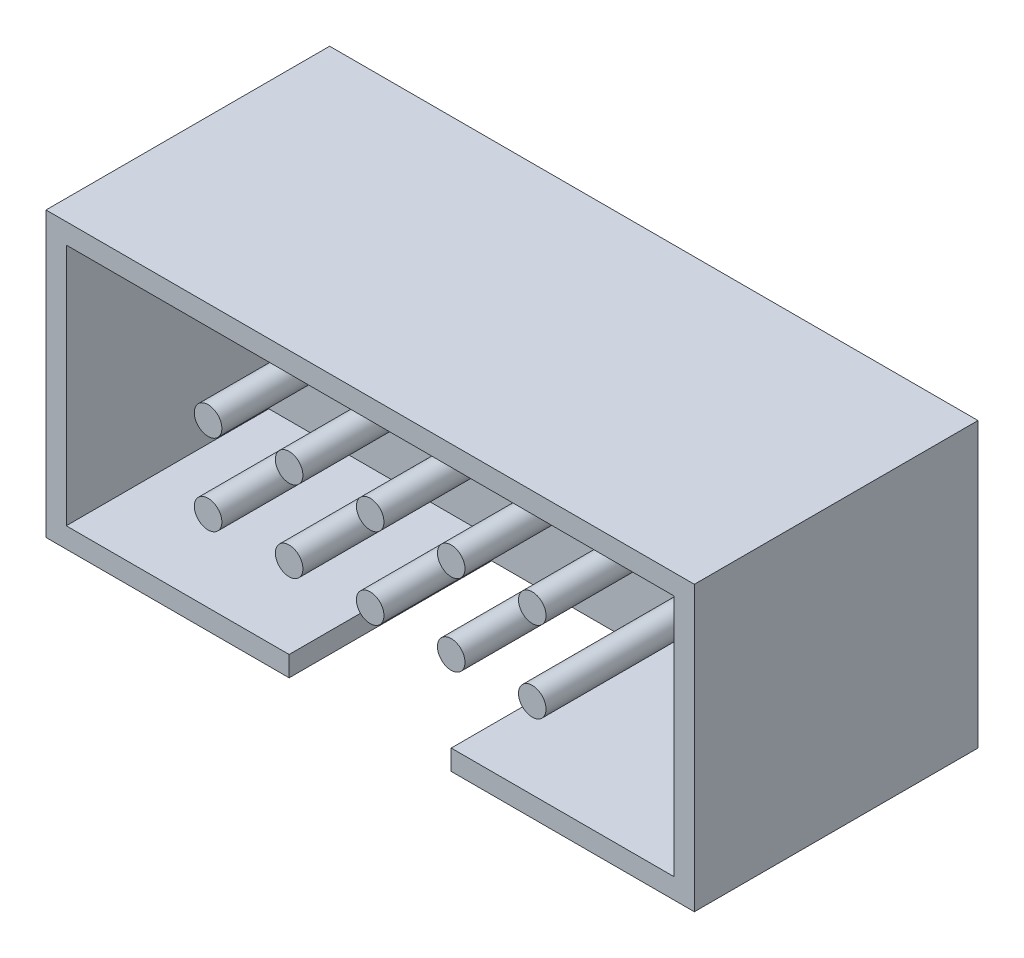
ISO-10303-21;
HEADER;
FILE_DESCRIPTION(('STEP AP214'),'2;1');
FILE_NAME('part.step','',(''),(''),'','','');
FILE_SCHEMA(('AUTOMOTIVE_DESIGN { 1 0 10303 214 1 1 1 1 }'));
ENDSEC;
DATA;
#1=APPLICATION_CONTEXT('core data for automotive mechanical design processes');
#2=APPLICATION_PROTOCOL_DEFINITION('international standard','automotive_design',2000,#1);
#3=PRODUCT_CONTEXT('',#1,'mechanical');
#4=PRODUCT('Part','Part','',(#3));
#5=PRODUCT_RELATED_PRODUCT_CATEGORY('part','',(#4));
#6=PRODUCT_DEFINITION_FORMATION('','',#4);
#7=PRODUCT_DEFINITION_CONTEXT('part definition',#1,'design');
#8=PRODUCT_DEFINITION('design','',#6,#7);
#9=PRODUCT_DEFINITION_SHAPE('','',#8);
#10=(LENGTH_UNIT() NAMED_UNIT(*) SI_UNIT(.MILLI.,.METRE.));
#11=(NAMED_UNIT(*) PLANE_ANGLE_UNIT() SI_UNIT($,.RADIAN.));
#12=(NAMED_UNIT(*) SI_UNIT($,.STERADIAN.) SOLID_ANGLE_UNIT());
#13=UNCERTAINTY_MEASURE_WITH_UNIT(LENGTH_MEASURE(1.E-05),#10,'distance_accuracy_value','');
#14=(GEOMETRIC_REPRESENTATION_CONTEXT(3) GLOBAL_UNCERTAINTY_ASSIGNED_CONTEXT((#13)) GLOBAL_UNIT_ASSIGNED_CONTEXT((#10,
#11,#12)) REPRESENTATION_CONTEXT('',''));
#15=CARTESIAN_POINT('',(0.,0.,0.));
#16=DIRECTION('',(0.,0.,1.));
#17=DIRECTION('',(1.,0.,0.));
#18=AXIS2_PLACEMENT_3D('',#15,#16,#17);
#19=CARTESIAN_POINT('',(10.16,2.54,8.89));
#20=DIRECTION('',(0.,0.,-1.));
#21=DIRECTION('',(-1.,0.,0.));
#22=AXIS2_PLACEMENT_3D('',#19,#20,#21);
#23=CYLINDRICAL_SURFACE('',#22,0.4318);
#24=CARTESIAN_POINT('',(10.16,2.54,8.89));
#25=DIRECTION('',(0.,0.,-1.));
#26=DIRECTION('',(-1.,0.,0.));
#27=AXIS2_PLACEMENT_3D('',#24,#25,#26);
#28=CIRCLE('',#27,0.4318);
#29=CARTESIAN_POINT('',(9.7282,2.54,8.89));
#30=VERTEX_POINT('',#29);
#31=EDGE_CURVE('E11',#30,#30,#28,.T.);
#32=ORIENTED_EDGE('',*,*,#31,.T.);
#33=EDGE_LOOP('',(#32));
#34=FACE_BOUND('',#33,.T.);
#35=CARTESIAN_POINT('',(10.16,2.54,-2.54));
#36=DIRECTION('',(0.,0.,-1.));
#37=DIRECTION('',(-1.,0.,0.));
#38=AXIS2_PLACEMENT_3D('',#35,#36,#37);
#39=CIRCLE('',#38,0.4318);
#40=CARTESIAN_POINT('',(9.7282,2.54,-2.54));
#41=VERTEX_POINT('',#40);
#42=EDGE_CURVE('E46',#41,#41,#39,.T.);
#43=ORIENTED_EDGE('',*,*,#42,.F.);
#44=EDGE_LOOP('',(#43));
#45=FACE_BOUND('',#44,.T.);
#46=ADVANCED_FACE('F40',(#34,#45),#23,.T.);
#47=CARTESIAN_POINT('',(10.16,2.54,8.89));
#48=DIRECTION('',(0.,0.,-1.));
#49=DIRECTION('',(-1.,0.,0.));
#50=AXIS2_PLACEMENT_3D('',#47,#48,#49);
#51=PLANE('',#50);
#52=ORIENTED_EDGE('',*,*,#31,.F.);
#53=EDGE_LOOP('',(#52));
#54=FACE_BOUND('',#53,.T.);
#55=ADVANCED_FACE('F55',(#54),#51,.F.);
#56=CARTESIAN_POINT('',(10.16,2.54,-2.54));
#57=DIRECTION('',(0.,0.,-1.));
#58=DIRECTION('',(-1.,0.,0.));
#59=AXIS2_PLACEMENT_3D('',#56,#57,#58);
#60=PLANE('',#59);
#61=ORIENTED_EDGE('',*,*,#42,.T.);
#62=EDGE_LOOP('',(#61));
#63=FACE_BOUND('',#62,.T.);
#64=ADVANCED_FACE('F52',(#63),#60,.T.);
#65=CLOSED_SHELL('',(#46,#55,#64));
#66=MANIFOLD_SOLID_BREP('B2',#65);
#67=CARTESIAN_POINT('',(7.62,2.54,8.89));
#68=DIRECTION('',(0.,0.,-1.));
#69=DIRECTION('',(-1.,0.,0.));
#70=AXIS2_PLACEMENT_3D('',#67,#68,#69);
#71=CYLINDRICAL_SURFACE('',#70,0.4318);
#72=CARTESIAN_POINT('',(7.62,2.54,8.89));
#73=DIRECTION('',(0.,0.,-1.));
#74=DIRECTION('',(-1.,0.,0.));
#75=AXIS2_PLACEMENT_3D('',#72,#73,#74);
#76=CIRCLE('',#75,0.4318);
#77=CARTESIAN_POINT('',(7.1882,2.54,8.89));
#78=VERTEX_POINT('',#77);
#79=EDGE_CURVE('E39',#78,#78,#76,.T.);
#80=ORIENTED_EDGE('',*,*,#79,.T.);
#81=EDGE_LOOP('',(#80));
#82=FACE_BOUND('',#81,.T.);
#83=CARTESIAN_POINT('',(7.62,2.54,-2.54));
#84=DIRECTION('',(0.,0.,-1.));
#85=DIRECTION('',(-1.,0.,0.));
#86=AXIS2_PLACEMENT_3D('',#83,#84,#85);
#87=CIRCLE('',#86,0.4318);
#88=CARTESIAN_POINT('',(7.1882,2.54,-2.54));
#89=VERTEX_POINT('',#88);
#90=EDGE_CURVE('E95',#89,#89,#87,.T.);
#91=ORIENTED_EDGE('',*,*,#90,.F.);
#92=EDGE_LOOP('',(#91));
#93=FACE_BOUND('',#92,.T.);
#94=ADVANCED_FACE('F89',(#82,#93),#71,.T.);
#95=CARTESIAN_POINT('',(7.62,2.54,8.89));
#96=DIRECTION('',(0.,0.,-1.));
#97=DIRECTION('',(-1.,0.,0.));
#98=AXIS2_PLACEMENT_3D('',#95,#96,#97);
#99=PLANE('',#98);
#100=ORIENTED_EDGE('',*,*,#79,.F.);
#101=EDGE_LOOP('',(#100));
#102=FACE_BOUND('',#101,.T.);
#103=ADVANCED_FACE('F104',(#102),#99,.F.);
#104=CARTESIAN_POINT('',(7.62,2.54,-2.54));
#105=DIRECTION('',(0.,0.,-1.));
#106=DIRECTION('',(-1.,0.,0.));
#107=AXIS2_PLACEMENT_3D('',#104,#105,#106);
#108=PLANE('',#107);
#109=ORIENTED_EDGE('',*,*,#90,.T.);
#110=EDGE_LOOP('',(#109));
#111=FACE_BOUND('',#110,.T.);
#112=ADVANCED_FACE('F101',(#111),#108,.T.);
#113=CLOSED_SHELL('',(#94,#103,#112));
#114=MANIFOLD_SOLID_BREP('B6',#113);
#115=CARTESIAN_POINT('',(5.08,2.54,8.89));
#116=DIRECTION('',(0.,0.,-1.));
#117=DIRECTION('',(-1.,0.,0.));
#118=AXIS2_PLACEMENT_3D('',#115,#116,#117);
#119=CYLINDRICAL_SURFACE('',#118,0.4318);
#120=CARTESIAN_POINT('',(5.08,2.54,8.89));
#121=DIRECTION('',(0.,0.,-1.));
#122=DIRECTION('',(-1.,0.,0.));
#123=AXIS2_PLACEMENT_3D('',#120,#121,#122);
#124=CIRCLE('',#123,0.4318);
#125=CARTESIAN_POINT('',(4.6482,2.54,8.89));
#126=VERTEX_POINT('',#125);
#127=EDGE_CURVE('E88',#126,#126,#124,.T.);
#128=ORIENTED_EDGE('',*,*,#127,.T.);
#129=EDGE_LOOP('',(#128));
#130=FACE_BOUND('',#129,.T.);
#131=CARTESIAN_POINT('',(5.08,2.54,-2.54));
#132=DIRECTION('',(0.,0.,-1.));
#133=DIRECTION('',(-1.,0.,0.));
#134=AXIS2_PLACEMENT_3D('',#131,#132,#133);
#135=CIRCLE('',#134,0.4318);
#136=CARTESIAN_POINT('',(4.6482,2.54,-2.54));
#137=VERTEX_POINT('',#136);
#138=EDGE_CURVE('E144',#137,#137,#135,.T.);
#139=ORIENTED_EDGE('',*,*,#138,.F.);
#140=EDGE_LOOP('',(#139));
#141=FACE_BOUND('',#140,.T.);
#142=ADVANCED_FACE('F138',(#130,#141),#119,.T.);
#143=CARTESIAN_POINT('',(5.08,2.54,8.89));
#144=DIRECTION('',(0.,0.,-1.));
#145=DIRECTION('',(-1.,0.,0.));
#146=AXIS2_PLACEMENT_3D('',#143,#144,#145);
#147=PLANE('',#146);
#148=ORIENTED_EDGE('',*,*,#127,.F.);
#149=EDGE_LOOP('',(#148));
#150=FACE_BOUND('',#149,.T.);
#151=ADVANCED_FACE('F153',(#150),#147,.F.);
#152=CARTESIAN_POINT('',(5.08,2.54,-2.54));
#153=DIRECTION('',(0.,0.,-1.));
#154=DIRECTION('',(-1.,0.,0.));
#155=AXIS2_PLACEMENT_3D('',#152,#153,#154);
#156=PLANE('',#155);
#157=ORIENTED_EDGE('',*,*,#138,.T.);
#158=EDGE_LOOP('',(#157));
#159=FACE_BOUND('',#158,.T.);
#160=ADVANCED_FACE('F150',(#159),#156,.T.);
#161=CLOSED_SHELL('',(#142,#151,#160));
#162=MANIFOLD_SOLID_BREP('B34',#161);
#163=CARTESIAN_POINT('',(2.54,2.54,8.89));
#164=DIRECTION('',(0.,0.,-1.));
#165=DIRECTION('',(-1.,0.,0.));
#166=AXIS2_PLACEMENT_3D('',#163,#164,#165);
#167=CYLINDRICAL_SURFACE('',#166,0.4318);
#168=CARTESIAN_POINT('',(2.54,2.54,8.89));
#169=DIRECTION('',(0.,0.,-1.));
#170=DIRECTION('',(-1.,0.,0.));
#171=AXIS2_PLACEMENT_3D('',#168,#169,#170);
#172=CIRCLE('',#171,0.4318);
#173=CARTESIAN_POINT('',(2.1082,2.54,8.89));
#174=VERTEX_POINT('',#173);
#175=EDGE_CURVE('E137',#174,#174,#172,.T.);
#176=ORIENTED_EDGE('',*,*,#175,.T.);
#177=EDGE_LOOP('',(#176));
#178=FACE_BOUND('',#177,.T.);
#179=CARTESIAN_POINT('',(2.54,2.54,-2.54));
#180=DIRECTION('',(0.,0.,-1.));
#181=DIRECTION('',(-1.,0.,0.));
#182=AXIS2_PLACEMENT_3D('',#179,#180,#181);
#183=CIRCLE('',#182,0.4318);
#184=CARTESIAN_POINT('',(2.1082,2.54,-2.54));
#185=VERTEX_POINT('',#184);
#186=EDGE_CURVE('E193',#185,#185,#183,.T.);
#187=ORIENTED_EDGE('',*,*,#186,.F.);
#188=EDGE_LOOP('',(#187));
#189=FACE_BOUND('',#188,.T.);
#190=ADVANCED_FACE('F187',(#178,#189),#167,.T.);
#191=CARTESIAN_POINT('',(2.54,2.54,8.89));
#192=DIRECTION('',(0.,0.,-1.));
#193=DIRECTION('',(-1.,0.,0.));
#194=AXIS2_PLACEMENT_3D('',#191,#192,#193);
#195=PLANE('',#194);
#196=ORIENTED_EDGE('',*,*,#175,.F.);
#197=EDGE_LOOP('',(#196));
#198=FACE_BOUND('',#197,.T.);
#199=ADVANCED_FACE('F202',(#198),#195,.F.);
#200=CARTESIAN_POINT('',(2.54,2.54,-2.54));
#201=DIRECTION('',(0.,0.,-1.));
#202=DIRECTION('',(-1.,0.,0.));
#203=AXIS2_PLACEMENT_3D('',#200,#201,#202);
#204=PLANE('',#203);
#205=ORIENTED_EDGE('',*,*,#186,.T.);
#206=EDGE_LOOP('',(#205));
#207=FACE_BOUND('',#206,.T.);
#208=ADVANCED_FACE('F199',(#207),#204,.T.);
#209=CLOSED_SHELL('',(#190,#199,#208));
#210=MANIFOLD_SOLID_BREP('B83',#209);
#211=CARTESIAN_POINT('',(10.16,0.,8.89));
#212=DIRECTION('',(0.,0.,-1.));
#213=DIRECTION('',(-1.,0.,0.));
#214=AXIS2_PLACEMENT_3D('',#211,#212,#213);
#215=CYLINDRICAL_SURFACE('',#214,0.4318);
#216=CARTESIAN_POINT('',(10.16,0.,8.89));
#217=DIRECTION('',(0.,0.,-1.));
#218=DIRECTION('',(-1.,0.,0.));
#219=AXIS2_PLACEMENT_3D('',#216,#217,#218);
#220=CIRCLE('',#219,0.4318);
#221=CARTESIAN_POINT('',(9.7282,0.,8.89));
#222=VERTEX_POINT('',#221);
#223=EDGE_CURVE('E186',#222,#222,#220,.T.);
#224=ORIENTED_EDGE('',*,*,#223,.T.);
#225=EDGE_LOOP('',(#224));
#226=FACE_BOUND('',#225,.T.);
#227=CARTESIAN_POINT('',(10.16,0.,-2.54));
#228=DIRECTION('',(0.,0.,-1.));
#229=DIRECTION('',(-1.,0.,0.));
#230=AXIS2_PLACEMENT_3D('',#227,#228,#229);
#231=CIRCLE('',#230,0.4318);
#232=CARTESIAN_POINT('',(9.7282,0.,-2.54));
#233=VERTEX_POINT('',#232);
#234=EDGE_CURVE('E242',#233,#233,#231,.T.);
#235=ORIENTED_EDGE('',*,*,#234,.F.);
#236=EDGE_LOOP('',(#235));
#237=FACE_BOUND('',#236,.T.);
#238=ADVANCED_FACE('F236',(#226,#237),#215,.T.);
#239=CARTESIAN_POINT('',(10.16,0.,8.89));
#240=DIRECTION('',(0.,0.,-1.));
#241=DIRECTION('',(-1.,0.,0.));
#242=AXIS2_PLACEMENT_3D('',#239,#240,#241);
#243=PLANE('',#242);
#244=ORIENTED_EDGE('',*,*,#223,.F.);
#245=EDGE_LOOP('',(#244));
#246=FACE_BOUND('',#245,.T.);
#247=ADVANCED_FACE('F251',(#246),#243,.F.);
#248=CARTESIAN_POINT('',(10.16,0.,-2.54));
#249=DIRECTION('',(0.,0.,-1.));
#250=DIRECTION('',(-1.,0.,0.));
#251=AXIS2_PLACEMENT_3D('',#248,#249,#250);
#252=PLANE('',#251);
#253=ORIENTED_EDGE('',*,*,#234,.T.);
#254=EDGE_LOOP('',(#253));
#255=FACE_BOUND('',#254,.T.);
#256=ADVANCED_FACE('F248',(#255),#252,.T.);
#257=CLOSED_SHELL('',(#238,#247,#256));
#258=MANIFOLD_SOLID_BREP('B132',#257);
#259=CARTESIAN_POINT('',(7.62,0.,8.89));
#260=DIRECTION('',(0.,0.,-1.));
#261=DIRECTION('',(-1.,0.,0.));
#262=AXIS2_PLACEMENT_3D('',#259,#260,#261);
#263=CYLINDRICAL_SURFACE('',#262,0.4318);
#264=CARTESIAN_POINT('',(7.62,0.,8.89));
#265=DIRECTION('',(0.,0.,-1.));
#266=DIRECTION('',(-1.,0.,0.));
#267=AXIS2_PLACEMENT_3D('',#264,#265,#266);
#268=CIRCLE('',#267,0.4318);
#269=CARTESIAN_POINT('',(7.1882,0.,8.89));
#270=VERTEX_POINT('',#269);
#271=EDGE_CURVE('E235',#270,#270,#268,.T.);
#272=ORIENTED_EDGE('',*,*,#271,.T.);
#273=EDGE_LOOP('',(#272));
#274=FACE_BOUND('',#273,.T.);
#275=CARTESIAN_POINT('',(7.62,0.,-2.54));
#276=DIRECTION('',(0.,0.,-1.));
#277=DIRECTION('',(-1.,0.,0.));
#278=AXIS2_PLACEMENT_3D('',#275,#276,#277);
#279=CIRCLE('',#278,0.4318);
#280=CARTESIAN_POINT('',(7.1882,0.,-2.54));
#281=VERTEX_POINT('',#280);
#282=EDGE_CURVE('E291',#281,#281,#279,.T.);
#283=ORIENTED_EDGE('',*,*,#282,.F.);
#284=EDGE_LOOP('',(#283));
#285=FACE_BOUND('',#284,.T.);
#286=ADVANCED_FACE('F285',(#274,#285),#263,.T.);
#287=CARTESIAN_POINT('',(7.62,0.,8.89));
#288=DIRECTION('',(0.,0.,-1.));
#289=DIRECTION('',(-1.,0.,0.));
#290=AXIS2_PLACEMENT_3D('',#287,#288,#289);
#291=PLANE('',#290);
#292=ORIENTED_EDGE('',*,*,#271,.F.);
#293=EDGE_LOOP('',(#292));
#294=FACE_BOUND('',#293,.T.);
#295=ADVANCED_FACE('F300',(#294),#291,.F.);
#296=CARTESIAN_POINT('',(7.62,0.,-2.54));
#297=DIRECTION('',(0.,0.,-1.));
#298=DIRECTION('',(-1.,0.,0.));
#299=AXIS2_PLACEMENT_3D('',#296,#297,#298);
#300=PLANE('',#299);
#301=ORIENTED_EDGE('',*,*,#282,.T.);
#302=EDGE_LOOP('',(#301));
#303=FACE_BOUND('',#302,.T.);
#304=ADVANCED_FACE('F297',(#303),#300,.T.);
#305=CLOSED_SHELL('',(#286,#295,#304));
#306=MANIFOLD_SOLID_BREP('B181',#305);
#307=CARTESIAN_POINT('',(5.08,0.,8.89));
#308=DIRECTION('',(0.,0.,-1.));
#309=DIRECTION('',(-1.,0.,0.));
#310=AXIS2_PLACEMENT_3D('',#307,#308,#309);
#311=CYLINDRICAL_SURFACE('',#310,0.4318);
#312=CARTESIAN_POINT('',(5.08,0.,8.89));
#313=DIRECTION('',(0.,0.,-1.));
#314=DIRECTION('',(-1.,0.,0.));
#315=AXIS2_PLACEMENT_3D('',#312,#313,#314);
#316=CIRCLE('',#315,0.4318);
#317=CARTESIAN_POINT('',(4.6482,0.,8.89));
#318=VERTEX_POINT('',#317);
#319=EDGE_CURVE('E284',#318,#318,#316,.T.);
#320=ORIENTED_EDGE('',*,*,#319,.T.);
#321=EDGE_LOOP('',(#320));
#322=FACE_BOUND('',#321,.T.);
#323=CARTESIAN_POINT('',(5.08,0.,-2.54));
#324=DIRECTION('',(0.,0.,-1.));
#325=DIRECTION('',(-1.,0.,0.));
#326=AXIS2_PLACEMENT_3D('',#323,#324,#325);
#327=CIRCLE('',#326,0.4318);
#328=CARTESIAN_POINT('',(4.6482,0.,-2.54));
#329=VERTEX_POINT('',#328);
#330=EDGE_CURVE('E340',#329,#329,#327,.T.);
#331=ORIENTED_EDGE('',*,*,#330,.F.);
#332=EDGE_LOOP('',(#331));
#333=FACE_BOUND('',#332,.T.);
#334=ADVANCED_FACE('F334',(#322,#333),#311,.T.);
#335=CARTESIAN_POINT('',(5.08,0.,8.89));
#336=DIRECTION('',(0.,0.,-1.));
#337=DIRECTION('',(-1.,0.,0.));
#338=AXIS2_PLACEMENT_3D('',#335,#336,#337);
#339=PLANE('',#338);
#340=ORIENTED_EDGE('',*,*,#319,.F.);
#341=EDGE_LOOP('',(#340));
#342=FACE_BOUND('',#341,.T.);
#343=ADVANCED_FACE('F349',(#342),#339,.F.);
#344=CARTESIAN_POINT('',(5.08,0.,-2.54));
#345=DIRECTION('',(0.,0.,-1.));
#346=DIRECTION('',(-1.,0.,0.));
#347=AXIS2_PLACEMENT_3D('',#344,#345,#346);
#348=PLANE('',#347);
#349=ORIENTED_EDGE('',*,*,#330,.T.);
#350=EDGE_LOOP('',(#349));
#351=FACE_BOUND('',#350,.T.);
#352=ADVANCED_FACE('F346',(#351),#348,.T.);
#353=CLOSED_SHELL('',(#334,#343,#352));
#354=MANIFOLD_SOLID_BREP('B230',#353);
#355=CARTESIAN_POINT('',(2.54,0.,8.89));
#356=DIRECTION('',(0.,0.,-1.));
#357=DIRECTION('',(-1.,0.,0.));
#358=AXIS2_PLACEMENT_3D('',#355,#356,#357);
#359=CYLINDRICAL_SURFACE('',#358,0.4318);
#360=CARTESIAN_POINT('',(2.54,0.,8.89));
#361=DIRECTION('',(0.,0.,-1.));
#362=DIRECTION('',(-1.,0.,0.));
#363=AXIS2_PLACEMENT_3D('',#360,#361,#362);
#364=CIRCLE('',#363,0.4318);
#365=CARTESIAN_POINT('',(2.1082,0.,8.89));
#366=VERTEX_POINT('',#365);
#367=EDGE_CURVE('E333',#366,#366,#364,.T.);
#368=ORIENTED_EDGE('',*,*,#367,.T.);
#369=EDGE_LOOP('',(#368));
#370=FACE_BOUND('',#369,.T.);
#371=CARTESIAN_POINT('',(2.54,0.,-2.54));
#372=DIRECTION('',(0.,0.,-1.));
#373=DIRECTION('',(-1.,0.,0.));
#374=AXIS2_PLACEMENT_3D('',#371,#372,#373);
#375=CIRCLE('',#374,0.4318);
#376=CARTESIAN_POINT('',(2.1082,0.,-2.54));
#377=VERTEX_POINT('',#376);
#378=EDGE_CURVE('E389',#377,#377,#375,.T.);
#379=ORIENTED_EDGE('',*,*,#378,.F.);
#380=EDGE_LOOP('',(#379));
#381=FACE_BOUND('',#380,.T.);
#382=ADVANCED_FACE('F383',(#370,#381),#359,.T.);
#383=CARTESIAN_POINT('',(2.54,0.,8.89));
#384=DIRECTION('',(0.,0.,-1.));
#385=DIRECTION('',(-1.,0.,0.));
#386=AXIS2_PLACEMENT_3D('',#383,#384,#385);
#387=PLANE('',#386);
#388=ORIENTED_EDGE('',*,*,#367,.F.);
#389=EDGE_LOOP('',(#388));
#390=FACE_BOUND('',#389,.T.);
#391=ADVANCED_FACE('F398',(#390),#387,.F.);
#392=CARTESIAN_POINT('',(2.54,0.,-2.54));
#393=DIRECTION('',(0.,0.,-1.));
#394=DIRECTION('',(-1.,0.,0.));
#395=AXIS2_PLACEMENT_3D('',#392,#393,#394);
#396=PLANE('',#395);
#397=ORIENTED_EDGE('',*,*,#378,.T.);
#398=EDGE_LOOP('',(#397));
#399=FACE_BOUND('',#398,.T.);
#400=ADVANCED_FACE('F395',(#399),#396,.T.);
#401=CLOSED_SHELL('',(#382,#391,#400));
#402=MANIFOLD_SOLID_BREP('B279',#401);
#403=CARTESIAN_POINT('',(0.,2.54,8.89));
#404=DIRECTION('',(0.,0.,-1.));
#405=DIRECTION('',(-1.,0.,0.));
#406=AXIS2_PLACEMENT_3D('',#403,#404,#405);
#407=CYLINDRICAL_SURFACE('',#406,0.4318);
#408=CARTESIAN_POINT('',(0.,2.54,8.89));
#409=DIRECTION('',(0.,0.,-1.));
#410=DIRECTION('',(-1.,0.,0.));
#411=AXIS2_PLACEMENT_3D('',#408,#409,#410);
#412=CIRCLE('',#411,0.4318);
#413=CARTESIAN_POINT('',(-0.4318,2.54,8.89));
#414=VERTEX_POINT('',#413);
#415=EDGE_CURVE('E382',#414,#414,#412,.T.);
#416=ORIENTED_EDGE('',*,*,#415,.T.);
#417=EDGE_LOOP('',(#416));
#418=FACE_BOUND('',#417,.T.);
#419=CARTESIAN_POINT('',(0.,2.54,-2.54));
#420=DIRECTION('',(0.,0.,-1.));
#421=DIRECTION('',(-1.,0.,0.));
#422=AXIS2_PLACEMENT_3D('',#419,#420,#421);
#423=CIRCLE('',#422,0.4318);
#424=CARTESIAN_POINT('',(-0.4318,2.54,-2.54));
#425=VERTEX_POINT('',#424);
#426=EDGE_CURVE('E438',#425,#425,#423,.T.);
#427=ORIENTED_EDGE('',*,*,#426,.F.);
#428=EDGE_LOOP('',(#427));
#429=FACE_BOUND('',#428,.T.);
#430=ADVANCED_FACE('F432',(#418,#429),#407,.T.);
#431=CARTESIAN_POINT('',(0.,2.54,8.89));
#432=DIRECTION('',(0.,0.,-1.));
#433=DIRECTION('',(-1.,0.,0.));
#434=AXIS2_PLACEMENT_3D('',#431,#432,#433);
#435=PLANE('',#434);
#436=ORIENTED_EDGE('',*,*,#415,.F.);
#437=EDGE_LOOP('',(#436));
#438=FACE_BOUND('',#437,.T.);
#439=ADVANCED_FACE('F447',(#438),#435,.F.);
#440=CARTESIAN_POINT('',(0.,2.54,-2.54));
#441=DIRECTION('',(0.,0.,-1.));
#442=DIRECTION('',(-1.,0.,0.));
#443=AXIS2_PLACEMENT_3D('',#440,#441,#442);
#444=PLANE('',#443);
#445=ORIENTED_EDGE('',*,*,#426,.T.);
#446=EDGE_LOOP('',(#445));
#447=FACE_BOUND('',#446,.T.);
#448=ADVANCED_FACE('F444',(#447),#444,.T.);
#449=CLOSED_SHELL('',(#430,#439,#448));
#450=MANIFOLD_SOLID_BREP('B328',#449);
#451=CARTESIAN_POINT('',(0.,0.,8.89));
#452=DIRECTION('',(0.,0.,-1.));
#453=DIRECTION('',(-1.,0.,0.));
#454=AXIS2_PLACEMENT_3D('',#451,#452,#453);
#455=CYLINDRICAL_SURFACE('',#454,0.4318);
#456=CARTESIAN_POINT('',(0.,0.,8.89));
#457=DIRECTION('',(0.,0.,-1.));
#458=DIRECTION('',(-1.,0.,0.));
#459=AXIS2_PLACEMENT_3D('',#456,#457,#458);
#460=CIRCLE('',#459,0.4318);
#461=CARTESIAN_POINT('',(-0.4318,0.,8.89));
#462=VERTEX_POINT('',#461);
#463=EDGE_CURVE('E431',#462,#462,#460,.T.);
#464=ORIENTED_EDGE('',*,*,#463,.T.);
#465=EDGE_LOOP('',(#464));
#466=FACE_BOUND('',#465,.T.);
#467=CARTESIAN_POINT('',(0.,0.,-2.54));
#468=DIRECTION('',(0.,0.,-1.));
#469=DIRECTION('',(-1.,0.,0.));
#470=AXIS2_PLACEMENT_3D('',#467,#468,#469);
#471=CIRCLE('',#470,0.4318);
#472=CARTESIAN_POINT('',(-0.4318,0.,-2.54));
#473=VERTEX_POINT('',#472);
#474=EDGE_CURVE('E488',#473,#473,#471,.T.);
#475=ORIENTED_EDGE('',*,*,#474,.F.);
#476=EDGE_LOOP('',(#475));
#477=FACE_BOUND('',#476,.T.);
#478=ADVANCED_FACE('F482',(#466,#477),#455,.T.);
#479=CARTESIAN_POINT('',(0.,0.,8.89));
#480=DIRECTION('',(0.,0.,-1.));
#481=DIRECTION('',(-1.,0.,0.));
#482=AXIS2_PLACEMENT_3D('',#479,#480,#481);
#483=PLANE('',#482);
#484=ORIENTED_EDGE('',*,*,#463,.F.);
#485=EDGE_LOOP('',(#484));
#486=FACE_BOUND('',#485,.T.);
#487=ADVANCED_FACE('F497',(#486),#483,.F.);
#488=CARTESIAN_POINT('',(0.,0.,-2.54));
#489=DIRECTION('',(0.,0.,-1.));
#490=DIRECTION('',(-1.,0.,0.));
#491=AXIS2_PLACEMENT_3D('',#488,#489,#490);
#492=PLANE('',#491);
#493=ORIENTED_EDGE('',*,*,#474,.T.);
#494=EDGE_LOOP('',(#493));
#495=FACE_BOUND('',#494,.T.);
#496=ADVANCED_FACE('F494',(#495),#492,.T.);
#497=CLOSED_SHELL('',(#478,#487,#496));
#498=MANIFOLD_SOLID_BREP('B377',#497);
#499=CARTESIAN_POINT('',(-5.08,-3.175,2.54));
#500=DIRECTION('',(0.,0.,1.));
#501=DIRECTION('',(1.,0.,0.));
#502=AXIS2_PLACEMENT_3D('',#499,#500,#501);
#503=PLANE('',#502);
#504=DIRECTION('',(1.,0.,0.));
#505=VECTOR('',#504,1.);
#506=CARTESIAN_POINT('',(-5.08,-3.175,2.54));
#507=LINE('',#506,#505);
#508=CARTESIAN_POINT('',(2.54,-3.175,2.54));
#509=VERTEX_POINT('',#508);
#510=CARTESIAN_POINT('',(7.62,-3.175,2.54));
#511=VERTEX_POINT('',#510);
#512=EDGE_CURVE('E692',#509,#511,#507,.T.);
#513=ORIENTED_EDGE('',*,*,#512,.T.);
#514=DIRECTION('',(0.,-1.,0.));
#515=VECTOR('',#514,1.);
#516=CARTESIAN_POINT('',(7.62,-3.175,2.54));
#517=LINE('',#516,#515);
#518=CARTESIAN_POINT('',(7.62,-2.54,2.54));
#519=VERTEX_POINT('',#518);
#520=EDGE_CURVE('E642',#519,#511,#517,.T.);
#521=ORIENTED_EDGE('',*,*,#520,.F.);
#522=DIRECTION('',(-1.,0.,0.));
#523=VECTOR('',#522,1.);
#524=CARTESIAN_POINT('',(7.62,-2.54,2.54));
#525=LINE('',#524,#523);
#526=CARTESIAN_POINT('',(14.605,-2.54,2.54));
#527=VERTEX_POINT('',#526);
#528=EDGE_CURVE('E638',#527,#519,#525,.T.);
#529=ORIENTED_EDGE('',*,*,#528,.F.);
#530=DIRECTION('',(0.,-1.,0.));
#531=VECTOR('',#530,1.);
#532=CARTESIAN_POINT('',(14.605,5.715,2.54));
#533=LINE('',#532,#531);
#534=CARTESIAN_POINT('',(14.605,5.08,2.54));
#535=VERTEX_POINT('',#534);
#536=EDGE_CURVE('E672',#535,#527,#533,.T.);
#537=ORIENTED_EDGE('',*,*,#536,.F.);
#538=DIRECTION('',(1.,0.,0.));
#539=VECTOR('',#538,1.);
#540=CARTESIAN_POINT('',(-4.445,5.08,2.54));
#541=LINE('',#540,#539);
#542=CARTESIAN_POINT('',(-4.445,5.08,2.54));
#543=VERTEX_POINT('',#542);
#544=EDGE_CURVE('E664',#543,#535,#541,.T.);
#545=ORIENTED_EDGE('',*,*,#544,.F.);
#546=DIRECTION('',(0.,1.,0.));
#547=VECTOR('',#546,1.);
#548=CARTESIAN_POINT('',(-4.445,5.715,2.54));
#549=LINE('',#548,#547);
#550=CARTESIAN_POINT('',(-4.445,-2.54,2.54));
#551=VERTEX_POINT('',#550);
#552=EDGE_CURVE('E527',#551,#543,#549,.T.);
#553=ORIENTED_EDGE('',*,*,#552,.F.);
#554=DIRECTION('',(-1.,0.,0.));
#555=VECTOR('',#554,1.);
#556=CARTESIAN_POINT('',(-4.445,-2.54,2.54));
#557=LINE('',#556,#555);
#558=CARTESIAN_POINT('',(2.54,-2.54,2.54));
#559=VERTEX_POINT('',#558);
#560=EDGE_CURVE('E647',#559,#551,#557,.T.);
#561=ORIENTED_EDGE('',*,*,#560,.F.);
#562=DIRECTION('',(0.,1.,0.));
#563=VECTOR('',#562,1.);
#564=CARTESIAN_POINT('',(2.54,-3.175,2.54));
#565=LINE('',#564,#563);
#566=EDGE_CURVE('E644',#509,#559,#565,.T.);
#567=ORIENTED_EDGE('',*,*,#566,.F.);
#568=EDGE_LOOP('',(#513,#521,#529,#537,#545,#553,#561,#567));
#569=FACE_BOUND('',#568,.T.);
#570=ADVANCED_FACE('F523',(#569),#503,.T.);
#571=CARTESIAN_POINT('',(14.605,5.715,8.89));
#572=DIRECTION('',(1.,0.,0.));
#573=DIRECTION('',(0.,0.,-1.));
#574=AXIS2_PLACEMENT_3D('',#571,#572,#573);
#575=PLANE('',#574);
#576=DIRECTION('',(0.,0.,-1.));
#577=VECTOR('',#576,1.);
#578=CARTESIAN_POINT('',(14.605,-2.54,8.89));
#579=LINE('',#578,#577);
#580=CARTESIAN_POINT('',(14.605,-2.54,8.89));
#581=VERTEX_POINT('',#580);
#582=EDGE_CURVE('E645',#581,#527,#579,.T.);
#583=ORIENTED_EDGE('',*,*,#582,.F.);
#584=DIRECTION('',(0.,-1.,0.));
#585=VECTOR('',#584,1.);
#586=CARTESIAN_POINT('',(14.605,5.715,8.89));
#587=LINE('',#586,#585);
#588=CARTESIAN_POINT('',(14.605,5.08,8.89));
#589=VERTEX_POINT('',#588);
#590=EDGE_CURVE('E627',#589,#581,#587,.T.);
#591=ORIENTED_EDGE('',*,*,#590,.F.);
#592=DIRECTION('',(0.,0.,-1.));
#593=VECTOR('',#592,1.);
#594=CARTESIAN_POINT('',(14.605,5.08,8.89));
#595=LINE('',#594,#593);
#596=EDGE_CURVE('E549',#589,#535,#595,.T.);
#597=ORIENTED_EDGE('',*,*,#596,.T.);
#598=ORIENTED_EDGE('',*,*,#536,.T.);
#599=EDGE_LOOP('',(#583,#591,#597,#598));
#600=FACE_BOUND('',#599,.T.);
#601=ADVANCED_FACE('F729',(#600),#575,.F.);
#602=CARTESIAN_POINT('',(-4.445,5.715,8.89));
#603=DIRECTION('',(-1.,0.,0.));
#604=DIRECTION('',(0.,-1.,0.));
#605=AXIS2_PLACEMENT_3D('',#602,#603,#604);
#606=PLANE('',#605);
#607=DIRECTION('',(0.,0.,-1.));
#608=VECTOR('',#607,1.);
#609=CARTESIAN_POINT('',(-4.445,-2.54,8.89));
#610=LINE('',#609,#608);
#611=CARTESIAN_POINT('',(-4.445,-2.54,8.89));
#612=VERTEX_POINT('',#611);
#613=EDGE_CURVE('E541',#612,#551,#610,.T.);
#614=ORIENTED_EDGE('',*,*,#613,.T.);
#615=ORIENTED_EDGE('',*,*,#552,.T.);
#616=DIRECTION('',(0.,0.,-1.));
#617=VECTOR('',#616,1.);
#618=CARTESIAN_POINT('',(-4.445,5.08,8.89));
#619=LINE('',#618,#617);
#620=CARTESIAN_POINT('',(-4.445,5.08,8.89));
#621=VERTEX_POINT('',#620);
#622=EDGE_CURVE('E669',#621,#543,#619,.T.);
#623=ORIENTED_EDGE('',*,*,#622,.F.);
#624=DIRECTION('',(0.,1.,0.));
#625=VECTOR('',#624,1.);
#626=CARTESIAN_POINT('',(-4.445,5.715,8.89));
#627=LINE('',#626,#625);
#628=EDGE_CURVE('E682',#612,#621,#627,.T.);
#629=ORIENTED_EDGE('',*,*,#628,.F.);
#630=EDGE_LOOP('',(#614,#615,#623,#629));
#631=FACE_BOUND('',#630,.T.);
#632=ADVANCED_FACE('F735',(#631),#606,.F.);
#633=CARTESIAN_POINT('',(-5.08,5.715,2.54));
#634=DIRECTION('',(1.,0.,0.));
#635=DIRECTION('',(0.,1.,0.));
#636=AXIS2_PLACEMENT_3D('',#633,#634,#635);
#637=PLANE('',#636);
#638=DIRECTION('',(0.,-1.,0.));
#639=VECTOR('',#638,1.);
#640=CARTESIAN_POINT('',(-5.08,5.715,0.));
#641=LINE('',#640,#639);
#642=CARTESIAN_POINT('',(-5.08,5.715,0.));
#643=VERTEX_POINT('',#642);
#644=CARTESIAN_POINT('',(-5.08,-3.175,0.));
#645=VERTEX_POINT('',#644);
#646=EDGE_CURVE('E686',#643,#645,#641,.T.);
#647=ORIENTED_EDGE('',*,*,#646,.T.);
#648=DIRECTION('',(0.,0.,-1.));
#649=VECTOR('',#648,1.);
#650=CARTESIAN_POINT('',(-5.08,-3.175,2.54));
#651=LINE('',#650,#649);
#652=CARTESIAN_POINT('',(-5.08,-3.175,8.89));
#653=VERTEX_POINT('',#652);
#654=EDGE_CURVE('E480',#653,#645,#651,.T.);
#655=ORIENTED_EDGE('',*,*,#654,.F.);
#656=DIRECTION('',(0.,-1.,0.));
#657=VECTOR('',#656,1.);
#658=CARTESIAN_POINT('',(-5.08,5.715,8.89));
#659=LINE('',#658,#657);
#660=CARTESIAN_POINT('',(-5.08,5.715,8.89));
#661=VERTEX_POINT('',#660);
#662=EDGE_CURVE('E678',#661,#653,#659,.T.);
#663=ORIENTED_EDGE('',*,*,#662,.F.);
#664=DIRECTION('',(0.,0.,-1.));
#665=VECTOR('',#664,1.);
#666=CARTESIAN_POINT('',(-5.08,5.715,2.54));
#667=LINE('',#666,#665);
#668=EDGE_CURVE('E693',#661,#643,#667,.T.);
#669=ORIENTED_EDGE('',*,*,#668,.T.);
#670=EDGE_LOOP('',(#647,#655,#663,#669));
#671=FACE_BOUND('',#670,.T.);
#672=ADVANCED_FACE('F525',(#671),#637,.F.);
#673=CARTESIAN_POINT('',(-5.08,-3.175,2.54));
#674=DIRECTION('',(0.,1.,0.));
#675=DIRECTION('',(0.,0.,1.));
#676=AXIS2_PLACEMENT_3D('',#673,#674,#675);
#677=PLANE('',#676);
#678=DIRECTION('',(1.,0.,0.));
#679=VECTOR('',#678,1.);
#680=CARTESIAN_POINT('',(-5.08,-3.175,0.));
#681=LINE('',#680,#679);
#682=CARTESIAN_POINT('',(15.24,-3.175,0.));
#683=VERTEX_POINT('',#682);
#684=EDGE_CURVE('E704',#645,#683,#681,.T.);
#685=ORIENTED_EDGE('',*,*,#684,.T.);
#686=DIRECTION('',(0.,0.,-1.));
#687=VECTOR('',#686,1.);
#688=CARTESIAN_POINT('',(15.24,-3.175,2.54));
#689=LINE('',#688,#687);
#690=CARTESIAN_POINT('',(15.24,-3.175,8.89));
#691=VERTEX_POINT('',#690);
#692=EDGE_CURVE('E533',#691,#683,#689,.T.);
#693=ORIENTED_EDGE('',*,*,#692,.F.);
#694=DIRECTION('',(1.,0.,0.));
#695=VECTOR('',#694,1.);
#696=CARTESIAN_POINT('',(15.24,-3.175,8.89));
#697=LINE('',#696,#695);
#698=CARTESIAN_POINT('',(7.62,-3.175,8.89));
#699=VERTEX_POINT('',#698);
#700=EDGE_CURVE('E616',#699,#691,#697,.T.);
#701=ORIENTED_EDGE('',*,*,#700,.F.);
#702=DIRECTION('',(0.,0.,-1.));
#703=VECTOR('',#702,1.);
#704=CARTESIAN_POINT('',(7.62,-3.175,8.89));
#705=LINE('',#704,#703);
#706=EDGE_CURVE('E621',#699,#511,#705,.T.);
#707=ORIENTED_EDGE('',*,*,#706,.T.);
#708=ORIENTED_EDGE('',*,*,#512,.F.);
#709=DIRECTION('',(0.,0.,-1.));
#710=VECTOR('',#709,1.);
#711=CARTESIAN_POINT('',(2.54,-3.175,8.89));
#712=LINE('',#711,#710);
#713=CARTESIAN_POINT('',(2.54,-3.175,8.89));
#714=VERTEX_POINT('',#713);
#715=EDGE_CURVE('E662',#714,#509,#712,.T.);
#716=ORIENTED_EDGE('',*,*,#715,.F.);
#717=DIRECTION('',(1.,0.,0.));
#718=VECTOR('',#717,1.);
#719=CARTESIAN_POINT('',(-5.08,-3.175,8.89));
#720=LINE('',#719,#718);
#721=EDGE_CURVE('E680',#653,#714,#720,.T.);
#722=ORIENTED_EDGE('',*,*,#721,.F.);
#723=ORIENTED_EDGE('',*,*,#654,.T.);
#724=EDGE_LOOP('',(#685,#693,#701,#707,#708,#716,#722,#723));
#725=FACE_BOUND('',#724,.T.);
#726=ADVANCED_FACE('F618',(#725),#677,.F.);
#727=CARTESIAN_POINT('',(15.24,5.715,2.54));
#728=DIRECTION('',(-1.,0.,0.));
#729=DIRECTION('',(0.,0.,1.));
#730=AXIS2_PLACEMENT_3D('',#727,#728,#729);
#731=PLANE('',#730);
#732=DIRECTION('',(0.,1.,0.));
#733=VECTOR('',#732,1.);
#734=CARTESIAN_POINT('',(15.24,5.715,0.));
#735=LINE('',#734,#733);
#736=CARTESIAN_POINT('',(15.24,5.715,0.));
#737=VERTEX_POINT('',#736);
#738=EDGE_CURVE('E703',#683,#737,#735,.T.);
#739=ORIENTED_EDGE('',*,*,#738,.T.);
#740=DIRECTION('',(0.,0.,-1.));
#741=VECTOR('',#740,1.);
#742=CARTESIAN_POINT('',(15.24,5.715,2.54));
#743=LINE('',#742,#741);
#744=CARTESIAN_POINT('',(15.24,5.715,8.89));
#745=VERTEX_POINT('',#744);
#746=EDGE_CURVE('E697',#745,#737,#743,.T.);
#747=ORIENTED_EDGE('',*,*,#746,.F.);
#748=DIRECTION('',(0.,1.,0.));
#749=VECTOR('',#748,1.);
#750=CARTESIAN_POINT('',(15.24,5.715,8.89));
#751=LINE('',#750,#749);
#752=EDGE_CURVE('E673',#691,#745,#751,.T.);
#753=ORIENTED_EDGE('',*,*,#752,.F.);
#754=ORIENTED_EDGE('',*,*,#692,.T.);
#755=EDGE_LOOP('',(#739,#747,#753,#754));
#756=FACE_BOUND('',#755,.T.);
#757=ADVANCED_FACE('F720',(#756),#731,.F.);
#758=CARTESIAN_POINT('',(-5.08,5.715,2.54));
#759=DIRECTION('',(0.,-1.,0.));
#760=DIRECTION('',(0.,0.,-1.));
#761=AXIS2_PLACEMENT_3D('',#758,#759,#760);
#762=PLANE('',#761);
#763=DIRECTION('',(-1.,0.,0.));
#764=VECTOR('',#763,1.);
#765=CARTESIAN_POINT('',(-5.08,5.715,0.));
#766=LINE('',#765,#764);
#767=EDGE_CURVE('E694',#737,#643,#766,.T.);
#768=ORIENTED_EDGE('',*,*,#767,.T.);
#769=ORIENTED_EDGE('',*,*,#668,.F.);
#770=DIRECTION('',(-1.,0.,0.));
#771=VECTOR('',#770,1.);
#772=CARTESIAN_POINT('',(-5.08,5.715,8.89));
#773=LINE('',#772,#771);
#774=EDGE_CURVE('E684',#745,#661,#773,.T.);
#775=ORIENTED_EDGE('',*,*,#774,.F.);
#776=ORIENTED_EDGE('',*,*,#746,.T.);
#777=EDGE_LOOP('',(#768,#769,#775,#776));
#778=FACE_BOUND('',#777,.T.);
#779=ADVANCED_FACE('F718',(#778),#762,.F.);
#780=CARTESIAN_POINT('',(-5.08,-3.175,0.));
#781=DIRECTION('',(0.,0.,1.));
#782=DIRECTION('',(1.,0.,0.));
#783=AXIS2_PLACEMENT_3D('',#780,#781,#782);
#784=PLANE('',#783);
#785=ORIENTED_EDGE('',*,*,#646,.F.);
#786=ORIENTED_EDGE('',*,*,#767,.F.);
#787=ORIENTED_EDGE('',*,*,#738,.F.);
#788=ORIENTED_EDGE('',*,*,#684,.F.);
#789=EDGE_LOOP('',(#785,#786,#787,#788));
#790=FACE_BOUND('',#789,.T.);
#791=ADVANCED_FACE('F712',(#790),#784,.F.);
#792=CARTESIAN_POINT('',(-5.08,-3.175,8.89));
#793=DIRECTION('',(0.,0.,1.));
#794=DIRECTION('',(1.,0.,0.));
#795=AXIS2_PLACEMENT_3D('',#792,#793,#794);
#796=PLANE('',#795);
#797=ORIENTED_EDGE('',*,*,#662,.T.);
#798=ORIENTED_EDGE('',*,*,#721,.T.);
#799=DIRECTION('',(0.,1.,0.));
#800=VECTOR('',#799,1.);
#801=CARTESIAN_POINT('',(2.54,-3.175,8.89));
#802=LINE('',#801,#800);
#803=CARTESIAN_POINT('',(2.54,-2.54,8.89));
#804=VERTEX_POINT('',#803);
#805=EDGE_CURVE('E653',#714,#804,#802,.T.);
#806=ORIENTED_EDGE('',*,*,#805,.T.);
#807=DIRECTION('',(-1.,0.,0.));
#808=VECTOR('',#807,1.);
#809=CARTESIAN_POINT('',(-4.445,-2.54,8.89));
#810=LINE('',#809,#808);
#811=EDGE_CURVE('E655',#804,#612,#810,.T.);
#812=ORIENTED_EDGE('',*,*,#811,.T.);
#813=ORIENTED_EDGE('',*,*,#628,.T.);
#814=DIRECTION('',(1.,0.,0.));
#815=VECTOR('',#814,1.);
#816=CARTESIAN_POINT('',(-4.445,5.08,8.89));
#817=LINE('',#816,#815);
#818=EDGE_CURVE('E665',#621,#589,#817,.T.);
#819=ORIENTED_EDGE('',*,*,#818,.T.);
#820=ORIENTED_EDGE('',*,*,#590,.T.);
#821=DIRECTION('',(-1.,0.,0.));
#822=VECTOR('',#821,1.);
#823=CARTESIAN_POINT('',(7.62,-2.54,8.89));
#824=LINE('',#823,#822);
#825=CARTESIAN_POINT('',(7.62,-2.54,8.89));
#826=VERTEX_POINT('',#825);
#827=EDGE_CURVE('E634',#581,#826,#824,.T.);
#828=ORIENTED_EDGE('',*,*,#827,.T.);
#829=DIRECTION('',(0.,-1.,0.));
#830=VECTOR('',#829,1.);
#831=CARTESIAN_POINT('',(7.62,-3.175,8.89));
#832=LINE('',#831,#830);
#833=EDGE_CURVE('E630',#826,#699,#832,.T.);
#834=ORIENTED_EDGE('',*,*,#833,.T.);
#835=ORIENTED_EDGE('',*,*,#700,.T.);
#836=ORIENTED_EDGE('',*,*,#752,.T.);
#837=ORIENTED_EDGE('',*,*,#774,.T.);
#838=EDGE_LOOP('',(#797,#798,#806,#812,#813,#819,#820,#828,#834,#835,#836,#837));
#839=FACE_BOUND('',#838,.T.);
#840=ADVANCED_FACE('F632',(#839),#796,.T.);
#841=CARTESIAN_POINT('',(-4.445,5.08,8.89));
#842=DIRECTION('',(0.,1.,0.));
#843=DIRECTION('',(0.,0.,1.));
#844=AXIS2_PLACEMENT_3D('',#841,#842,#843);
#845=PLANE('',#844);
#846=ORIENTED_EDGE('',*,*,#544,.T.);
#847=ORIENTED_EDGE('',*,*,#596,.F.);
#848=ORIENTED_EDGE('',*,*,#818,.F.);
#849=ORIENTED_EDGE('',*,*,#622,.T.);
#850=EDGE_LOOP('',(#846,#847,#848,#849));
#851=FACE_BOUND('',#850,.T.);
#852=ADVANCED_FACE('F745',(#851),#845,.F.);
#853=CARTESIAN_POINT('',(2.54,-3.175,8.89));
#854=DIRECTION('',(-1.,0.,0.));
#855=DIRECTION('',(0.,0.,1.));
#856=AXIS2_PLACEMENT_3D('',#853,#854,#855);
#857=PLANE('',#856);
#858=ORIENTED_EDGE('',*,*,#566,.T.);
#859=DIRECTION('',(0.,0.,-1.));
#860=VECTOR('',#859,1.);
#861=CARTESIAN_POINT('',(2.54,-2.54,8.89));
#862=LINE('',#861,#860);
#863=EDGE_CURVE('E659',#804,#559,#862,.T.);
#864=ORIENTED_EDGE('',*,*,#863,.F.);
#865=ORIENTED_EDGE('',*,*,#805,.F.);
#866=ORIENTED_EDGE('',*,*,#715,.T.);
#867=EDGE_LOOP('',(#858,#864,#865,#866));
#868=FACE_BOUND('',#867,.T.);
#869=ADVANCED_FACE('F749',(#868),#857,.F.);
#870=CARTESIAN_POINT('',(-4.445,-2.54,8.89));
#871=DIRECTION('',(0.,-1.,0.));
#872=DIRECTION('',(0.,0.,-1.));
#873=AXIS2_PLACEMENT_3D('',#870,#871,#872);
#874=PLANE('',#873);
#875=ORIENTED_EDGE('',*,*,#560,.T.);
#876=ORIENTED_EDGE('',*,*,#613,.F.);
#877=ORIENTED_EDGE('',*,*,#811,.F.);
#878=ORIENTED_EDGE('',*,*,#863,.T.);
#879=EDGE_LOOP('',(#875,#876,#877,#878));
#880=FACE_BOUND('',#879,.T.);
#881=ADVANCED_FACE('F754',(#880),#874,.F.);
#882=CARTESIAN_POINT('',(7.62,-3.175,8.89));
#883=DIRECTION('',(1.,0.,0.));
#884=DIRECTION('',(0.,0.,-1.));
#885=AXIS2_PLACEMENT_3D('',#882,#883,#884);
#886=PLANE('',#885);
#887=ORIENTED_EDGE('',*,*,#520,.T.);
#888=ORIENTED_EDGE('',*,*,#706,.F.);
#889=ORIENTED_EDGE('',*,*,#833,.F.);
#890=DIRECTION('',(0.,0.,-1.));
#891=VECTOR('',#890,1.);
#892=CARTESIAN_POINT('',(7.62,-2.54,8.89));
#893=LINE('',#892,#891);
#894=EDGE_CURVE('E649',#826,#519,#893,.T.);
#895=ORIENTED_EDGE('',*,*,#894,.T.);
#896=EDGE_LOOP('',(#887,#888,#889,#895));
#897=FACE_BOUND('',#896,.T.);
#898=ADVANCED_FACE('F640',(#897),#886,.F.);
#899=CARTESIAN_POINT('',(7.62,-2.54,8.89));
#900=DIRECTION('',(0.,-1.,0.));
#901=DIRECTION('',(0.,0.,-1.));
#902=AXIS2_PLACEMENT_3D('',#899,#900,#901);
#903=PLANE('',#902);
#904=ORIENTED_EDGE('',*,*,#528,.T.);
#905=ORIENTED_EDGE('',*,*,#894,.F.);
#906=ORIENTED_EDGE('',*,*,#827,.F.);
#907=ORIENTED_EDGE('',*,*,#582,.T.);
#908=EDGE_LOOP('',(#904,#905,#906,#907));
#909=FACE_BOUND('',#908,.T.);
#910=ADVANCED_FACE('F760',(#909),#903,.F.);
#911=CLOSED_SHELL('',(#570,#601,#632,#672,#726,#757,#779,#791,#840,#852,#869,#881,#898,#910));
#912=MANIFOLD_SOLID_BREP('B426',#911);
#913=ADVANCED_BREP_SHAPE_REPRESENTATION('',(#18,#66,#114,#162,#210,#258,#306,#354,#402,#450,
#498,#912),#14);
#914=SHAPE_DEFINITION_REPRESENTATION(#9,#913);
ENDSEC;
END-ISO-10303-21;
